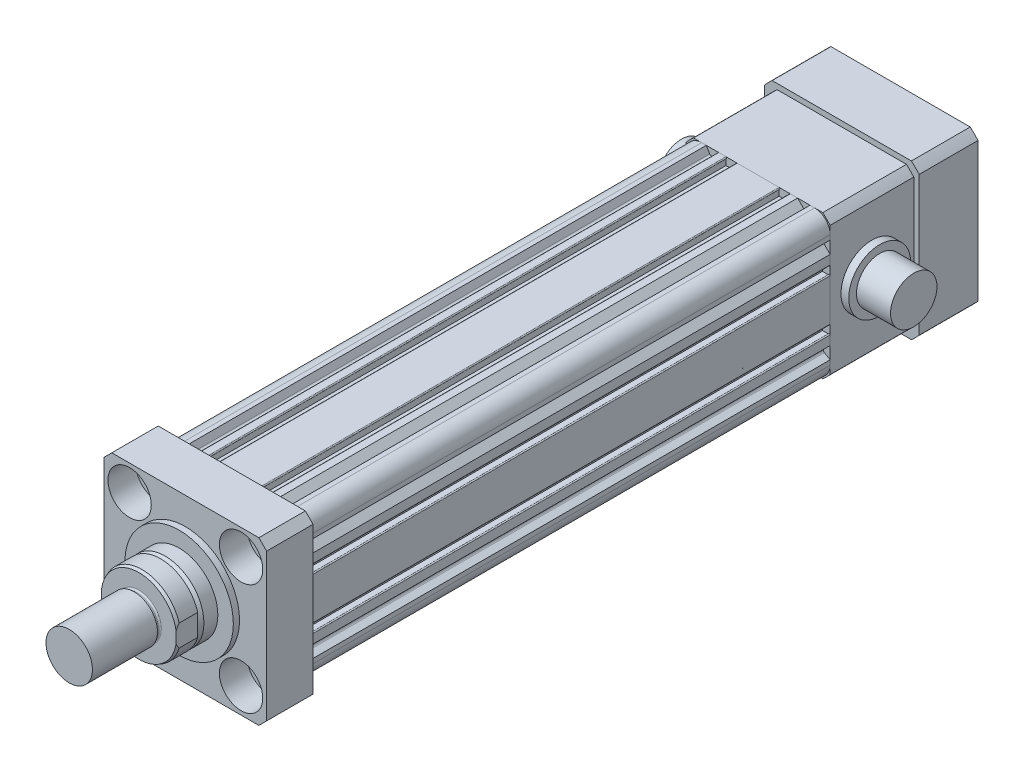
from build123d import *
from OCP.BRepFilletAPI import BRepFilletAPI_MakeChamfer

# Parameters (mm, degrees)
SKETCH_1_R          = 40
SKETCH_1_R_2        = 4.35
EXTRUDE_1_DEPTH     = 340
EXTRUDE_1_2_DEPTH   = 30
SKETCH_3_R          = 35
EXTRUDE_2_DEPTH     = 4
SKETCH_3_3_R        = 6.5
CUT_EXTRUDE_1_DEPTH = 30
SKETCH_3_4_R        = 6.5
CUT_EXTRUDE_2_DEPTH = 17
SKETCH_4_R          = 25
EXTRUDE_3_DEPTH     = 12
CHAMFER_1_SIZE      = 3
CHAMFER_1_SIZE2     = 1.732050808
EXTRUDE_4_DEPTH     = 14
CHAMFER_2_SIZE      = 2
CHAMFER_2_SIZE2     = 0.727940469
SKETCH_6_R          = 13.5
EXTRUDE_5_DEPTH     = 3
SKETCH_7_R          = 15
EXTRUDE_6_DEPTH     = 42
FILLET_1_R          = 1
EXTRUDE_7_DEPTH     = 54
EXTRUDE_8_DEPTH     = 38
SKETCH_10_R         = 40
CUT_EXTRUDE_3_DEPTH = 18.5
SKETCH_11_R         = 32
CUT_EXTRUDE_4_DEPTH = 15
SKETCH_12_R         = 15
EXTRUDE_9_DEPTH     = 30
EXTRUDE_START       = -90
SKETCH_12_2_R       = 15
EXTRUDE_10_DEPTH    = 30
SKETCH_13_R         = 20
SKETCH_13_R_2       = 15
EXTRUDE_11_DEPTH    = 5
EXTRUDE_START_2     = -93
SKETCH_13_2_R       = 20
SKETCH_13_2_R_2     = 15
EXTRUDE_12_DEPTH    = 5
SKETCH_14_W         = 105
SKETCH_14_H         = 105
EXTRUDE_13_DEPTH    = 30
SKETCH_15_R         = 14
CUT_EXTRUDE_5_DEPTH = 18
SKETCH_16_R         = 6.5
CUT_EXTRUDE_6_DEPTH = 30
CHAMFER_3_SIZE      = 5


with BuildPart() as part:
    # Sketch 1 → Extrude 1 (new body)
    with BuildSketch(Plane.XY):
        with BuildLine():
            Line((46.5, -36.5), (46.5, -33.5))
            Line((46.5, -33.5), (42.782554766, -31.353731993))
            ThreePointArc((42.782554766, -31.353731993), (42.192820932, -30.47113294), (42.534026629, -29.465973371))
            Line((42.534026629, -29.465973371), (46.5, -25.5))
            Line((46.5, -25.5), (46.5, -19.6))
            ThreePointArc((46.5, -19.6), (46.353553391, -19.246446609), (46, -19.1))
            ThreePointArc((46, -19.1), (45.646446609, -19.246446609), (45.5, -19.6))
            Line((45.5, -19.6), (41.5, -19.6))
            Line((41.5, -19.6), (41.5, -13.5))
            Line((41.5, -13.5), (45.5, -13.5))
            ThreePointArc((45.5, -13.5), (45.646446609, -13.853553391), (46, -14))
            ThreePointArc((46, -14), (46.353553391, -13.853553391), (46.5, -13.5))
            Line((46.5, -13.5), (46.5, 13.5))
            ThreePointArc((46.5, 13.5), (46.353553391, 13.853553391), (46, 14))
            ThreePointArc((46, 14), (45.646446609, 13.853553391), (45.5, 13.5))
            Line((45.5, 13.5), (41.5, 13.5))
            Line((41.5, 13.5), (41.5, 19.6))
            Line((41.5, 19.6), (45.5, 19.6))
            ThreePointArc((45.5, 19.6), (45.646446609, 19.246446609), (46, 19.1))
            ThreePointArc((46, 19.1), (46.353553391, 19.246446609), (46.5, 19.6))
            Line((46.5, 19.6), (46.5, 25.5))
            Line((46.5, 25.5), (42.534026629, 29.465973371))
            ThreePointArc((42.534026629, 29.465973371), (42.192820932, 30.47113294), (42.782554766, 31.353731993))
            Line((42.782554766, 31.353731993), (46.5, 33.5))
            Line((46.5, 33.5), (46.5, 36.5))
            ThreePointArc((46.5, 36.5), (43.571067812, 43.571067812), (36.5, 46.5))
            Line((36.5, 46.5), (33.5, 46.5))
            Line((33.5, 46.5), (31.353731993, 42.782554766))
            ThreePointArc((31.353731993, 42.782554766), (30.47113294, 42.192820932), (29.465973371, 42.534026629))
            Line((29.465973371, 42.534026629), (25.5, 46.5))
            Line((25.5, 46.5), (20.8, 46.5))
            ThreePointArc((20.8, 46.5), (20.446446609, 46.353553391), (20.3, 46))
            ThreePointArc((20.3, 46), (20.446446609, 45.646446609), (20.8, 45.5))
            Line((20.8, 45.5), (20.8, 41.5))
            Line((20.8, 41.5), (13.5, 41.5))
            Line((13.5, 41.5), (13.5, 45.5))
            ThreePointArc((13.5, 45.5), (13.853553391, 45.646446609), (14, 46))
            ThreePointArc((14, 46), (13.853553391, 46.353553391), (13.5, 46.5))
            Line((13.5, 46.5), (-13.5, 46.5))
            ThreePointArc((-13.5, 46.5), (-13.853553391, 46.353553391), (-14, 46))
            ThreePointArc((-14, 46), (-13.853553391, 45.646446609), (-13.5, 45.5))
            Line((-13.5, 45.5), (-13.5, 41.5))
            Line((-13.5, 41.5), (-20.8, 41.5))
            Line((-20.8, 41.5), (-20.8, 45.5))
            ThreePointArc((-20.8, 45.5), (-20.446446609, 45.646446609), (-20.3, 46))
            ThreePointArc((-20.3, 46), (-20.446446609, 46.353553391), (-20.8, 46.5))
            Line((-20.8, 46.5), (-25.5, 46.5))
            Line((-25.5, 46.5), (-29.465973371, 42.534026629))
            ThreePointArc((-29.465973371, 42.534026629), (-30.47113294, 42.192820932), (-31.353731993, 42.782554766))
            Line((-31.353731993, 42.782554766), (-33.5, 46.5))
            Line((-33.5, 46.5), (-36.5, 46.5))
            ThreePointArc((-36.5, 46.5), (-43.571067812, 43.571067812), (-46.5, 36.5))
            Line((-46.5, 36.5), (-46.5, 33.5))
            Line((-46.5, 33.5), (-42.782554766, 31.353731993))
            ThreePointArc((-42.782554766, 31.353731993), (-42.192820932, 30.47113294), (-42.534026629, 29.465973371))
            Line((-42.534026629, 29.465973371), (-46.5, 25.5))
            Line((-46.5, 25.5), (-46.5, 20))
            ThreePointArc((-46.5, 20), (-46.353553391, 19.646446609), (-46, 19.5))
            ThreePointArc((-46, 19.5), (-45.646446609, 19.646446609), (-45.5, 20))
            Line((-45.5, 20), (-41.5, 20))
            Line((-41.5, 20), (-41.5, 13.9))
            Line((-41.5, 13.9), (-45.5, 13.9))
            ThreePointArc((-45.5, 13.9), (-45.646446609, 14.253553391), (-46, 14.4))
            ThreePointArc((-46, 14.4), (-46.353553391, 14.253553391), (-46.5, 13.9))
            Line((-46.5, 13.9), (-46.5, -13.9))
            ThreePointArc((-46.5, -13.9), (-46.353553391, -14.253553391), (-46, -14.4))
            ThreePointArc((-46, -14.4), (-45.646446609, -14.253553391), (-45.5, -13.9))
            Line((-45.5, -13.9), (-41.5, -13.9))
            Line((-41.5, -13.9), (-41.5, -20))
            Line((-41.5, -20), (-45.5, -20))
            ThreePointArc((-45.5, -20), (-45.646446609, -19.646446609), (-46, -19.5))
            ThreePointArc((-46, -19.5), (-46.353553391, -19.646446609), (-46.5, -20))
            Line((-46.5, -20), (-46.5, -25.5))
            Line((-46.5, -25.5), (-42.534026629, -29.465973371))
            ThreePointArc((-42.534026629, -29.465973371), (-42.192820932, -30.47113294), (-42.782554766, -31.353731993))
            Line((-42.782554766, -31.353731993), (-46.5, -33.5))
            Line((-46.5, -33.5), (-46.5, -36.5))
            ThreePointArc((-46.5, -36.5), (-43.571067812, -43.571067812), (-36.5, -46.5))
            Line((-36.5, -46.5), (-33.5, -46.5))
            Line((-33.5, -46.5), (-31.353731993, -42.782554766))
            ThreePointArc((-31.353731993, -42.782554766), (-30.47113294, -42.192820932), (-29.465973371, -42.534026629))
            Line((-29.465973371, -42.534026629), (-25.5, -46.5))
            Line((-25.5, -46.5), (25.5, -46.5))
            Line((25.5, -46.5), (29.465973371, -42.534026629))
            ThreePointArc((29.465973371, -42.534026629), (30.47113294, -42.192820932), (31.353731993, -42.782554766))
            Line((31.353731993, -42.782554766), (33.5, -46.5))
            Line((33.5, -46.5), (36.5, -46.5))
            ThreePointArc((36.5, -46.5), (43.571067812, -43.571067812), (46.5, -36.5))
        make_face()
        Circle(SKETCH_1_R, mode=Mode.SUBTRACT)
        with Locations((36, -36)):
            Circle(SKETCH_1_R_2, mode=Mode.SUBTRACT)
        with Locations((-36, -36)):
            Circle(SKETCH_1_R_2, mode=Mode.SUBTRACT)
        with Locations((36, 36)):
            Circle(SKETCH_1_R_2, mode=Mode.SUBTRACT)
        with Locations((-36, 36)):
            Circle(SKETCH_1_R_2, mode=Mode.SUBTRACT)
        with BuildLine():
            Line((25.75, -42.5), (11.324751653, -42.5))
            ThreePointArc((11.324751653, -42.5), (10.829080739, -42.065653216), (11.194582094, -41.517241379))
            ThreePointArc((11.194582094, -41.517241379), (18.919894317, -38.613956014), (25.948275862, -34.288292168))
            ThreePointArc((25.948275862, -34.288292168), (26.472640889, -34.239297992), (26.75, -34.68699324))
            Line((26.75, -34.68699324), (26.75, -41.5))
            Line((26.75, -41.5), (25.75, -42.5))
        make_face(mode=Mode.SUBTRACT)
        with BuildLine():
            Line((-25.75, -42.5), (-11.324751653, -42.5))
            ThreePointArc((-11.324751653, -42.5), (-10.829080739, -42.065653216), (-11.194582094, -41.517241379))
            ThreePointArc((-11.194582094, -41.517241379), (-18.919894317, -38.613956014), (-25.948275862, -34.288292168))
            ThreePointArc((-25.948275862, -34.288292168), (-26.472640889, -34.239297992), (-26.75, -34.68699324))
            Line((-26.75, -34.68699324), (-26.75, -41.5))
            Line((-26.75, -41.5), (-25.75, -42.5))
        make_face(mode=Mode.SUBTRACT)
        with BuildLine():
            Line((26.312283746, 40), (20.798294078, 40))
            ThreePointArc((20.798294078, 40), (20.548294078, 39.933012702), (20.365281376, 39.75))
            Line((20.365281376, 39.75), (19.794336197, 38.761093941))
            ThreePointArc((19.794336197, 38.761093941), (19.747068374, 38.372059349), (19.994850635, 38.068437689))
            ThreePointArc((19.994850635, 38.068437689), (22.57372353, 36.598183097), (25.045011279, 34.953503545))
            ThreePointArc((25.045011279, 34.953503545), (25.441798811, 34.871210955), (25.769245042, 35.109939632))
            Line((25.769245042, 35.109939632), (27.64187192, 38.353424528))
            ThreePointArc((27.64187192, 38.353424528), (27.704581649, 38.668687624), (27.562412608, 38.956977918))
            Line((27.562412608, 38.956977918), (26.665837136, 39.853553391))
            ThreePointArc((26.665837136, 39.853553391), (26.503625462, 39.961939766), (26.312283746, 40))
        make_face(mode=Mode.SUBTRACT)
        with BuildLine():
            Line((38.956977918, 27.562412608), (39.853553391, 26.665837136))
            ThreePointArc((39.853553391, 26.665837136), (39.961939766, 26.503625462), (40, 26.312283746))
            Line((40, 26.312283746), (40, 20.798294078))
            ThreePointArc((40, 20.798294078), (39.933012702, 20.548294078), (39.75, 20.365281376))
            Line((39.75, 20.365281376), (38.761093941, 19.794336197))
            ThreePointArc((38.761093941, 19.794336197), (38.372059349, 19.747068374), (38.068437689, 19.994850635))
            ThreePointArc((38.068437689, 19.994850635), (36.598183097, 22.57372353), (34.953503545, 25.045011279))
            ThreePointArc((34.953503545, 25.045011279), (34.871210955, 25.441798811), (35.109939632, 25.769245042))
            Line((35.109939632, 25.769245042), (38.353424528, 27.64187192))
            ThreePointArc((38.353424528, 27.64187192), (38.668687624, 27.704581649), (38.956977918, 27.562412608))
        make_face(mode=Mode.SUBTRACT)
        with BuildLine():
            Line((38.956977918, -27.562412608), (39.853553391, -26.665837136))
            ThreePointArc((39.853553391, -26.665837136), (39.961939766, -26.503625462), (40, -26.312283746))
            Line((40, -26.312283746), (40, -20.798294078))
            ThreePointArc((40, -20.798294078), (39.933012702, -20.548294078), (39.75, -20.365281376))
            Line((39.75, -20.365281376), (38.761093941, -19.794336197))
            ThreePointArc((38.761093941, -19.794336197), (38.372059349, -19.747068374), (38.068437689, -19.994850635))
            ThreePointArc((38.068437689, -19.994850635), (36.598183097, -22.57372353), (34.953503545, -25.045011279))
            ThreePointArc((34.953503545, -25.045011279), (34.871210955, -25.441798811), (35.109939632, -25.769245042))
            Line((35.109939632, -25.769245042), (38.353424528, -27.64187192))
            ThreePointArc((38.353424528, -27.64187192), (38.668687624, -27.704581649), (38.956977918, -27.562412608))
        make_face(mode=Mode.SUBTRACT)
        with BuildLine():
            Line((-39.75, -20.365281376), (-38.761093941, -19.794336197))
            ThreePointArc((-38.761093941, -19.794336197), (-38.372059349, -19.747068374), (-38.068437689, -19.994850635))
            ThreePointArc((-38.068437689, -19.994850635), (-36.598183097, -22.57372353), (-34.953503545, -25.045011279))
            ThreePointArc((-34.953503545, -25.045011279), (-34.871210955, -25.441798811), (-35.109939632, -25.769245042))
            Line((-35.109939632, -25.769245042), (-38.353424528, -27.64187192))
            ThreePointArc((-38.353424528, -27.64187192), (-38.668687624, -27.704581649), (-38.956977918, -27.562412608))
            Line((-38.956977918, -27.562412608), (-39.853553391, -26.665837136))
            ThreePointArc((-39.853553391, -26.665837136), (-39.961939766, -26.503625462), (-40, -26.312283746))
            Line((-40, -26.312283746), (-40, -20.798294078))
            ThreePointArc((-40, -20.798294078), (-39.933012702, -20.548294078), (-39.75, -20.365281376))
        make_face(mode=Mode.SUBTRACT)
        with BuildLine():
            Line((-20.365281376, 39.75), (-19.794336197, 38.761093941))
            ThreePointArc((-19.794336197, 38.761093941), (-19.747068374, 38.372059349), (-19.994850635, 38.068437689))
            ThreePointArc((-19.994850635, 38.068437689), (-22.57372353, 36.598183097), (-25.045011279, 34.953503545))
            ThreePointArc((-25.045011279, 34.953503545), (-25.441798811, 34.871210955), (-25.769245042, 35.109939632))
            Line((-25.769245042, 35.109939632), (-27.64187192, 38.353424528))
            ThreePointArc((-27.64187192, 38.353424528), (-27.704581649, 38.668687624), (-27.562412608, 38.956977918))
            Line((-27.562412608, 38.956977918), (-26.665837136, 39.853553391))
            ThreePointArc((-26.665837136, 39.853553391), (-26.503625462, 39.961939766), (-26.312283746, 40))
            Line((-26.312283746, 40), (-20.798294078, 40))
            ThreePointArc((-20.798294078, 40), (-20.548294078, 39.933012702), (-20.365281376, 39.75))
        make_face(mode=Mode.SUBTRACT)
        with BuildLine():
            Line((-38.956977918, 27.562412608), (-39.853553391, 26.665837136))
            ThreePointArc((-39.853553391, 26.665837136), (-39.961939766, 26.503625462), (-40, 26.312283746))
            Line((-40, 26.312283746), (-40, 20.798294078))
            ThreePointArc((-40, 20.798294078), (-39.933012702, 20.548294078), (-39.75, 20.365281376))
            Line((-39.75, 20.365281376), (-38.761093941, 19.794336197))
            ThreePointArc((-38.761093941, 19.794336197), (-38.372059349, 19.747068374), (-38.068437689, 19.994850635))
            ThreePointArc((-38.068437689, 19.994850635), (-36.598183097, 22.57372353), (-34.953503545, 25.045011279))
            ThreePointArc((-34.953503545, 25.045011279), (-34.871210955, 25.441798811), (-35.109939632, 25.769245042))
            Line((-35.109939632, 25.769245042), (-38.353424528, 27.64187192))
            ThreePointArc((-38.353424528, 27.64187192), (-38.668687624, 27.704581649), (-38.956977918, 27.562412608))
        make_face(mode=Mode.SUBTRACT)
    extrude(amount=EXTRUDE_1_DEPTH)

    # Sketch 2 → Extrude 1 2 (add)
    with BuildSketch(Plane.XY.offset(340)):
        Polygon((-52.5, 50.5), (-50.5, 52.5), (50.5, 52.5), (52.5, 50.5), (52.5, -50.5), (50.5, -52.5), (-50.5, -52.5), (-52.5, -50.5), align=None)
    extrude(amount=EXTRUDE_1_2_DEPTH)

    # Sketch 3 → Extrude 2 (add)
    with BuildSketch(Plane.XY.offset(370)):
        Circle(SKETCH_3_R)
    extrude(amount=EXTRUDE_2_DEPTH)

    # Sketch 3_3 → Cut-Extrude 1 (cut)
    with BuildSketch(Plane.XY.offset(370)):
        with Locations((-36, 36)):
            Circle(SKETCH_3_3_R)
        with Locations((36, 36)):
            Circle(SKETCH_3_3_R)
        with Locations((60, 32.5)):
            Circle(SKETCH_3_3_R)
        with Locations((36, -36)):
            Circle(SKETCH_3_3_R)
        with Locations((-36, -36)):
            Circle(SKETCH_3_3_R)
        with Locations((-60, -32.5)):
            Circle(SKETCH_3_3_R)
        with Locations((-60, 32.5)):
            Circle(SKETCH_3_3_R)
    extrude(amount=-CUT_EXTRUDE_1_DEPTH, mode=Mode.SUBTRACT)

    # Sketch 3_4 → Cut-Extrude 2 (cut)
    # profile 1 of 4: a face of its own
    with BuildSketch(Plane.XY.offset(370)):
        with BuildLine():
            Line((50, 52.5), (22, 52.5))
            Line((22, 52.5), (22, 36))
            ThreePointArc((22, 36), (36, 22), (50, 36))
            Line((50, 36), (50, 52.5))
        make_face()
        with Locations((36, 36)):
            Circle(SKETCH_3_4_R, mode=Mode.SUBTRACT)
    # profile 2 of 4: a face of its own
    with BuildSketch(Plane.XY.offset(370)):
        with BuildLine():
            Line((50, -52.5), (50, -36))
            ThreePointArc((50, -36), (36, -22), (22, -36))
            Line((22, -36), (22, -52.5))
            Line((22, -52.5), (50, -52.5))
        make_face()
        with Locations((36, -36)):
            Circle(SKETCH_3_4_R, mode=Mode.SUBTRACT)
    # profile 3 of 4: a face of its own
    with BuildSketch(Plane.XY.offset(370)):
        with BuildLine():
            Line((-50, -52.5), (-22, -52.5))
            Line((-22, -52.5), (-22, -36))
            ThreePointArc((-22, -36), (-36, -22), (-50, -36))
            Line((-50, -36), (-50, -52.5))
        make_face()
        with Locations((-36, -36)):
            Circle(SKETCH_3_4_R, mode=Mode.SUBTRACT)
    # profile 4 of 4: a face of its own
    with BuildSketch(Plane.XY.offset(370)):
        with BuildLine():
            Line((-50, 36), (-50, 52.5))
            Line((-50, 52.5), (-22, 52.5))
            Line((-22, 52.5), (-22, 36))
            ThreePointArc((-22, 36), (-36, 22), (-50, 36))
        make_face()
    extrude(amount=-CUT_EXTRUDE_2_DEPTH, mode=Mode.SUBTRACT)

    # Sketch 4 → Extrude 3 (add)
    with BuildSketch(Plane.XY.offset(374)):
        Circle(SKETCH_4_R)
    extrude(amount=EXTRUDE_3_DEPTH)

    # Chamfer 1
    chamfer_1_edges = [part.edges().sort_by_distance(p)[0] for p in [
        (-25, 0, 386),
    ]]
    chamfer_1_side = [part.faces().sort_by_distance(p)[0] for p in [
        (-25, 0, 380),
    ]]
    chamfer(chamfer_1_edges, length=CHAMFER_1_SIZE, length2=CHAMFER_1_SIZE2, reference=chamfer_1_side[0])

    # Sketch 5 → Extrude 4 (add)
    with BuildSketch(Plane.XY.offset(386)):
        with BuildLine():
            Line((-24, 7), (-24, -7))
            ThreePointArc((-24, -7), (0, -25), (24, -7))
            Line((24, -7), (24, 7))
            ThreePointArc((24, 7), (0, 25), (-24, 7))
        make_face()
    extrude(amount=EXTRUDE_4_DEPTH)

    # Chamfer 2: one chamfer whose edges measure the first distance from different faces: ONE call of the kernel's chamfer builder (chamfer() names one face for all edges)
    chamfer_2_edges_1 = [part.edges().sort_by_distance(p)[0] for p in [
        (0, 25, 400),
    ]]
    chamfer_2_side_1 = [part.faces().sort_by_distance(p)[0] for p in [
        (0, 25, 393),
    ]]
    chamfer_2_edges_2 = [part.edges().sort_by_distance(p)[0] for p in [
        (0, -25, 400),
    ]]
    chamfer_2_side_2 = [part.faces().sort_by_distance(p)[0] for p in [
        (0, -25, 393),
    ]]
    chamfer_2 = BRepFilletAPI_MakeChamfer(part.part.solid().wrapped)
    for e in chamfer_2_edges_1:
        chamfer_2.Add(CHAMFER_2_SIZE, CHAMFER_2_SIZE2, e.wrapped, chamfer_2_side_1[0].wrapped)  # the first distance lies on this face
    for e in chamfer_2_edges_2:
        chamfer_2.Add(CHAMFER_2_SIZE, CHAMFER_2_SIZE2, e.wrapped, chamfer_2_side_2[0].wrapped)  # the first distance lies on this face
    add(Compound.cast(chamfer_2.Shape()), mode=Mode.REPLACE)

    # Sketch 6 → Extrude 5 (add)
    with BuildSketch(Plane.XY.offset(400)):
        Circle(SKETCH_6_R)
    extrude(amount=EXTRUDE_5_DEPTH)

    # Sketch 7 → Extrude 6 (add)
    with BuildSketch(Plane.XY.offset(403)):
        with Locations(Location((0, 0, 0), (0, 0, 180))):
            Circle(SKETCH_7_R)
    extrude(amount=EXTRUDE_6_DEPTH)

    # Fillet 1
    fillet_1_edges = [part.edges().sort_by_distance(p)[0] for p in [
        (-13.5, 0, 400),
    ]]
    fillet(fillet_1_edges, radius=FILLET_1_R)

    # Sketch 14 → Extrude 13 (add)
    with BuildSketch(Plane.XY.offset(370)):
        Rectangle(SKETCH_14_W, SKETCH_14_H)
    extrude(amount=-EXTRUDE_13_DEPTH)

    # Sketch 15 → Cut-Extrude 5 (cut)
    with BuildSketch(Plane.XY.offset(370)):
        with Locations((-36, 36)):
            Circle(SKETCH_15_R)
        with Locations((36, 36)):
            Circle(SKETCH_15_R)
        with Locations((36, -36)):
            Circle(SKETCH_15_R)
        with Locations((-36, -36)):
            Circle(SKETCH_15_R)
    extrude(amount=-CUT_EXTRUDE_5_DEPTH, mode=Mode.SUBTRACT)

    # Sketch 16 → Cut-Extrude 6 (cut)
    with BuildSketch(Plane.XY.offset(352)):
        with Locations((-36, 36)):
            Circle(SKETCH_16_R)
        with Locations((36, 36)):
            Circle(SKETCH_16_R)
        with Locations((36, -36)):
            Circle(SKETCH_16_R)
        with Locations((-36, -36)):
            Circle(SKETCH_16_R)
    extrude(amount=-CUT_EXTRUDE_6_DEPTH, mode=Mode.SUBTRACT)

    # Chamfer 3
    chamfer_3_edges = [part.edges().sort_by_distance(p)[0] for p in [
        (52.5, 52.5, 355),
        (-52.5, -52.5, 355),
        (52.5, -52.5, 355),
        (-52.5, 52.5, 355),
    ]]
    chamfer(chamfer_3_edges, length=CHAMFER_3_SIZE)


with BuildPart() as body_2:
    # Sketch 8 → Extrude 7 (new body)
    with BuildSketch(Plane(origin=(0, 0, 0), x_dir=(-1, 0, 0), z_dir=(0, 0, -1))):
        with BuildLine():
            Line((-41.761226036, 46.5), (41.761226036, 46.5))
            ThreePointArc((41.761226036, 46.5), (44.194173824, 44.194173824), (46.5, 41.761226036))
            Line((46.5, 41.761226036), (46.5, -41.761226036))
            ThreePointArc((46.5, -41.761226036), (44.194173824, -44.194173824), (41.761226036, -46.5))
            Line((41.761226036, -46.5), (-41.761226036, -46.5))
            ThreePointArc((-41.761226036, -46.5), (-44.194173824, -44.194173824), (-46.5, -41.761226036))
            Line((-46.5, -41.761226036), (-46.5, 41.761226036))
            ThreePointArc((-46.5, 41.761226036), (-44.194173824, 44.194173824), (-41.761226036, 46.5))
        make_face()
    extrude(amount=EXTRUDE_7_DEPTH)

    # Sketch 9 → Extrude 8 (add)
    with BuildSketch(Plane(origin=(0, 0, -54), x_dir=(-1, 0, 0), z_dir=(0, 0, -1))):
        with BuildLine():
            Line((-44.972908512, 50), (44.972908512, 50))
            ThreePointArc((44.972908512, 50), (47.552931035, 47.552931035), (50, 44.972908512))
            Line((50, 44.972908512), (50, -44.972908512))
            ThreePointArc((50, -44.972908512), (47.552931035, -47.552931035), (44.972908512, -50))
            Line((44.972908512, -50), (-44.972908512, -50))
            ThreePointArc((-44.972908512, -50), (-47.552931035, -47.552931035), (-50, -44.972908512))
            Line((-50, -44.972908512), (-50, 44.972908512))
            ThreePointArc((-50, 44.972908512), (-47.552931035, 47.552931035), (-44.972908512, 50))
        make_face()
    extrude(amount=EXTRUDE_8_DEPTH)

    # Sketch 10 → Cut-Extrude 3 (cut)
    with BuildSketch(Plane(origin=(0, 0, -92), x_dir=(-1, 0, 0), z_dir=(0, 0, -1))):
        Circle(SKETCH_10_R)
    extrude(amount=-CUT_EXTRUDE_3_DEPTH, mode=Mode.SUBTRACT)

    # Sketch 11 → Cut-Extrude 4 (cut)
    with BuildSketch(Plane(origin=(0, 0, -73.5), x_dir=(-1, 0, 0), z_dir=(0, 0, -1))):
        Circle(SKETCH_11_R)
    extrude(amount=-CUT_EXTRUDE_4_DEPTH, mode=Mode.SUBTRACT)

    # Sketch 12 → Extrude 9 (add)
    with BuildSketch(Plane.ZY.offset(46.5)):
        with Locations(Location((-27, 0, 0), (0, 0, 90))):
            Circle(SKETCH_12_R)
    extrude(amount=EXTRUDE_9_DEPTH)

    # Sketch 12_2 → Extrude 10 (add)
    with BuildSketch(Plane.ZY.offset(46.5).offset(EXTRUDE_START)):
        with Locations(Location((-27, 0, 0), (0, 0, 90))):
            Circle(SKETCH_12_2_R)
    extrude(amount=-EXTRUDE_10_DEPTH)

    # Sketch 13 → Extrude 11 (add)
    with BuildSketch(Plane.ZY.offset(46.5)):
        with Locations(Location((-27, 0, 0), (0, 0, 90))):
            Circle(SKETCH_13_R)
        with Locations(Location((-27, 0, 0), (0, 0, 270))):
            Circle(SKETCH_13_R_2, mode=Mode.SUBTRACT)
    extrude(amount=EXTRUDE_11_DEPTH)

    # Sketch 13_2 → Extrude 12 (add)
    with BuildSketch(Plane.ZY.offset(46.5).offset(EXTRUDE_START_2)):
        with Locations(Location((-27, 0, 0), (0, 0, 90))):
            Circle(SKETCH_13_2_R)
        with Locations(Location((-27, 0, 0), (0, 0, 270))):
            Circle(SKETCH_13_2_R_2, mode=Mode.SUBTRACT)
    extrude(amount=-EXTRUDE_12_DEPTH)


solid = Compound([part.part, body_2.part])
